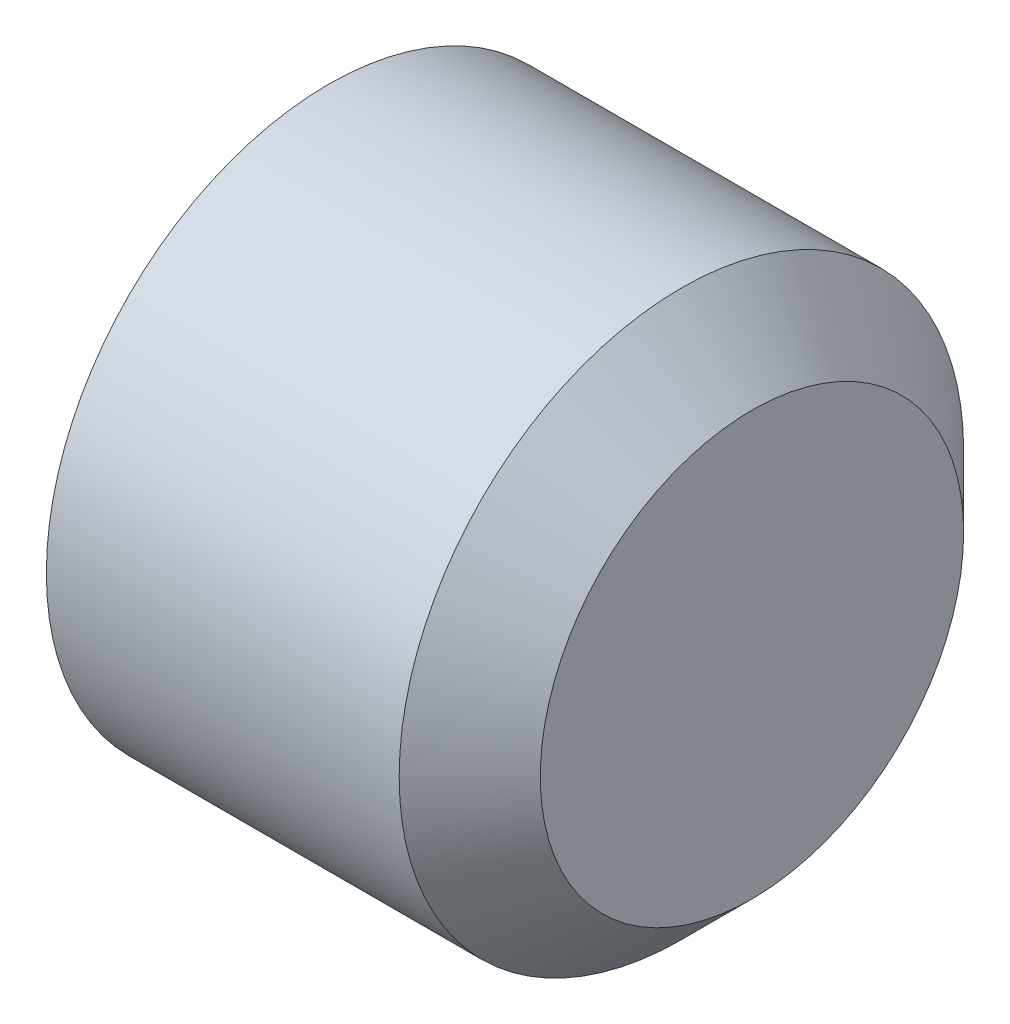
from build123d import *


with BuildPart() as part:
    # Esquisse1 → R_volution1 (revolve)
    with BuildSketch(Plane.XY, mode=Mode.PRIVATE) as r_volution1_sk:
        Polygon((0, 2), (0, 0), (3, 0), (3, 1.5), (2.5, 2), align=None)
    revolve(r_volution1_sk.sketch.rotate(Axis((0, 0, 0), (1, 0, 0)), 270), axis=Axis((0, 0, 0), (1, 0, 0)))


solid = part.part
